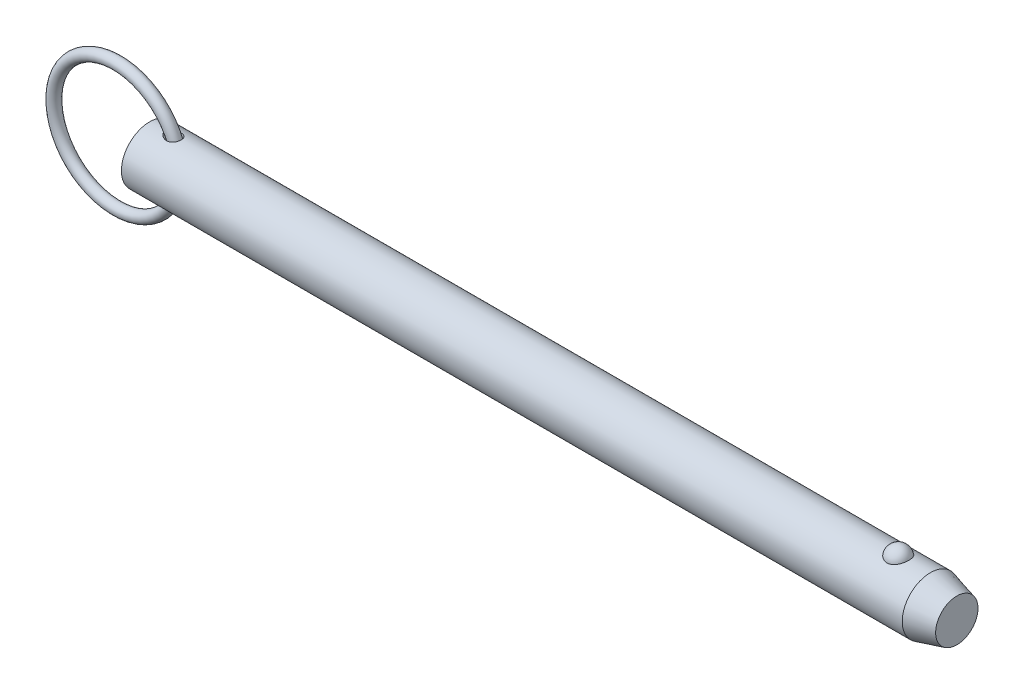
ISO-10303-21;
HEADER;
FILE_DESCRIPTION(('STEP AP214'),'2;1');
FILE_NAME('part.step','',(''),(''),'','','');
FILE_SCHEMA(('AUTOMOTIVE_DESIGN { 1 0 10303 214 1 1 1 1 }'));
ENDSEC;
DATA;
#1=APPLICATION_CONTEXT('core data for automotive mechanical design processes');
#2=APPLICATION_PROTOCOL_DEFINITION('international standard','automotive_design',2000,#1);
#3=PRODUCT_CONTEXT('',#1,'mechanical');
#4=PRODUCT('Part','Part','',(#3));
#5=PRODUCT_RELATED_PRODUCT_CATEGORY('part','',(#4));
#6=PRODUCT_DEFINITION_FORMATION('','',#4);
#7=PRODUCT_DEFINITION_CONTEXT('part definition',#1,'design');
#8=PRODUCT_DEFINITION('design','',#6,#7);
#9=PRODUCT_DEFINITION_SHAPE('','',#8);
#10=(LENGTH_UNIT() NAMED_UNIT(*) SI_UNIT(.MILLI.,.METRE.));
#11=(NAMED_UNIT(*) PLANE_ANGLE_UNIT() SI_UNIT($,.RADIAN.));
#12=(NAMED_UNIT(*) SI_UNIT($,.STERADIAN.) SOLID_ANGLE_UNIT());
#13=UNCERTAINTY_MEASURE_WITH_UNIT(LENGTH_MEASURE(1.E-05),#10,'distance_accuracy_value','');
#14=(GEOMETRIC_REPRESENTATION_CONTEXT(3) GLOBAL_UNCERTAINTY_ASSIGNED_CONTEXT((#13)) GLOBAL_UNIT_ASSIGNED_CONTEXT((#10,
#11,#12)) REPRESENTATION_CONTEXT('',''));
#15=CARTESIAN_POINT('',(0.,0.,0.));
#16=DIRECTION('',(0.,0.,1.));
#17=DIRECTION('',(1.,0.,0.));
#18=AXIS2_PLACEMENT_3D('',#15,#16,#17);
#19=CARTESIAN_POINT('',(-8.23730968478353,0.,0.));
#20=DIRECTION('',(0.,0.,1.));
#21=DIRECTION('',(1.,0.,0.));
#22=AXIS2_PLACEMENT_3D('',#19,#20,#21);
#23=TOROIDAL_SURFACE('',#22,15.875,1.422);
#24=CARTESIAN_POINT('',(9.05969031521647,0.,0.));
#25=VERTEX_POINT('',#24);
#26=VERTEX_LOOP('',#25);
#27=FACE_BOUND('',#26,.T.);
#28=ADVANCED_FACE('P0_F12',(#27),#23,.T.);
#29=CLOSED_SHELL('',(#28));
#30=MANIFOLD_SOLID_BREP('P0_B1',#29);
#31=CARTESIAN_POINT('',(0.,0.,0.));
#32=DIRECTION('',(1.,0.,0.));
#33=DIRECTION('',(0.,0.,-1.));
#34=AXIS2_PLACEMENT_3D('',#31,#32,#33);
#35=CYLINDRICAL_SURFACE('',#34,7.11);
#36=CARTESIAN_POINT('',(3.98467340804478,7.10072679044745,-0.363013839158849));
#37=CARTESIAN_POINT('',(4.00971652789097,7.09600153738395,-0.45539194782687));
#38=CARTESIAN_POINT('',(4.04401947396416,7.08958406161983,-0.545230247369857));
#39=CARTESIAN_POINT('',(4.12810160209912,7.07427055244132,-0.717157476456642));
#40=CARTESIAN_POINT('',(4.17791765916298,7.06536861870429,-0.799227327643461));
#41=CARTESIAN_POINT('',(4.28924471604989,7.04620300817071,-0.953469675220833));
#42=CARTESIAN_POINT('',(4.35063580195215,7.035953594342,-1.02573162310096));
#43=CARTESIAN_POINT('',(4.48282610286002,7.01493313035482,-1.16081412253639));
#44=CARTESIAN_POINT('',(4.55362244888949,7.00416223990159,-1.22363754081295));
#45=CARTESIAN_POINT('',(4.71659336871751,6.98090398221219,-1.35055080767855));
#46=CARTESIAN_POINT('',(4.81029272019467,6.96847103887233,-1.41269256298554));
#47=CARTESIAN_POINT('',(5.0057240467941,6.94515366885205,-1.52319699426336));
#48=CARTESIAN_POINT('',(5.10746392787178,6.93427079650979,-1.57154588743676));
#49=CARTESIAN_POINT('',(5.33503739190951,6.91346066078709,-1.66091325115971));
#50=CARTESIAN_POINT('',(5.46199550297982,6.90402388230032,-1.69921932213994));
#51=CARTESIAN_POINT('',(5.72084799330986,6.89024030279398,-1.75428261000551));
#52=CARTESIAN_POINT('',(5.85274301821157,6.88589416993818,-1.77103699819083));
#53=CARTESIAN_POINT('',(6.11557710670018,6.88337277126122,-1.78081990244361));
#54=CARTESIAN_POINT('',(6.24650031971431,6.88510489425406,-1.77420448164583));
#55=CARTESIAN_POINT('',(6.50446311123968,6.89478744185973,-1.73620392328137));
#56=CARTESIAN_POINT('',(6.6315075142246,6.90272978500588,-1.70485097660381));
#57=CARTESIAN_POINT('',(6.85933269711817,6.92243075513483,-1.62281888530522));
#58=CARTESIAN_POINT('',(6.96133251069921,6.93352131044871,-1.5753580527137));
#59=CARTESIAN_POINT('',(7.15436649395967,6.95824811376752,-1.46226310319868));
#60=CARTESIAN_POINT('',(7.24540699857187,6.97188287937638,-1.3966395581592));
#61=CARTESIAN_POINT('',(7.40446019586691,6.99838217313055,-1.25668991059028));
#62=CARTESIAN_POINT('',(7.473875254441,7.01118308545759,-1.18393777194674));
#63=CARTESIAN_POINT('',(7.59904891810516,7.03582803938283,-1.02736918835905));
#64=CARTESIAN_POINT('',(7.65481029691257,7.04767227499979,-0.943554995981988));
#65=CARTESIAN_POINT('',(7.74982438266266,7.06873077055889,-0.76979592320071));
#66=CARTESIAN_POINT('',(7.7894903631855,7.07800861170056,-0.680084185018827));
#67=CARTESIAN_POINT('',(7.85354088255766,7.09334756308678,-0.495102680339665));
#68=CARTESIAN_POINT('',(7.87792559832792,7.09940871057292,-0.399832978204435));
#69=CARTESIAN_POINT('',(7.9108898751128,7.10766731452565,-0.206294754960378));
#70=CARTESIAN_POINT('',(7.91944662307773,7.10985919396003,-0.108022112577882));
#71=CARTESIAN_POINT('',(7.920501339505,7.11012756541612,0.0886168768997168));
#72=CARTESIAN_POINT('',(7.91299895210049,7.10820396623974,0.186983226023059));
#73=CARTESIAN_POINT('',(7.88205794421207,7.10043733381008,0.381270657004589));
#74=CARTESIAN_POINT('',(7.85857985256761,7.09458459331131,0.477185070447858));
#75=CARTESIAN_POINT('',(7.79617406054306,7.07958431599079,0.663575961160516));
#76=CARTESIAN_POINT('',(7.75724672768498,7.07043685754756,0.754052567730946));
#77=CARTESIAN_POINT('',(7.66496731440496,7.04987259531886,0.926798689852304));
#78=CARTESIAN_POINT('',(7.61164530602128,7.0384605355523,1.00908483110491));
#79=CARTESIAN_POINT('',(7.49191707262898,7.01461776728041,1.16333092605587));
#80=CARTESIAN_POINT('',(7.42551210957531,7.00218715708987,1.235291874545));
#81=CARTESIAN_POINT('',(7.28164031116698,6.97770944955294,1.36680167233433));
#82=CARTESIAN_POINT('',(7.20420170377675,6.96566146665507,1.42638126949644));
#83=CARTESIAN_POINT('',(7.0403906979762,6.94319963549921,1.53199377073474));
#84=CARTESIAN_POINT('',(6.95401827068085,6.93278579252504,1.57802663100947));
#85=CARTESIAN_POINT('',(6.7731858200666,6.91444459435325,1.65656940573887));
#86=CARTESIAN_POINT('',(6.67860569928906,6.90656682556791,1.68881327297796));
#87=CARTESIAN_POINT('',(6.48544119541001,6.89422806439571,1.73849768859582));
#88=CARTESIAN_POINT('',(6.38685561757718,6.88976809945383,1.755933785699));
#89=CARTESIAN_POINT('',(6.18089829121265,6.88429907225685,1.77726234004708));
#90=CARTESIAN_POINT('',(6.07340937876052,6.88356485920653,1.78007646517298));
#91=CARTESIAN_POINT('',(5.85921220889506,6.886086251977,1.77029087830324));
#92=CARTESIAN_POINT('',(5.75250426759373,6.88934339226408,1.75768523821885));
#93=CARTESIAN_POINT('',(5.52848027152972,6.89994454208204,1.71563399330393));
#94=CARTESIAN_POINT('',(5.41155168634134,6.90775772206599,1.68424184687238));
#95=CARTESIAN_POINT('',(5.18376466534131,6.92670168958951,1.60454711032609));
#96=CARTESIAN_POINT('',(5.07291446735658,6.9378368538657,1.5562221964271));
#97=CARTESIAN_POINT('',(4.84835244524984,6.96347168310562,1.43744827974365));
#98=CARTESIAN_POINT('',(4.73562531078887,6.97820486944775,1.36517310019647));
#99=CARTESIAN_POINT('',(4.52504912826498,7.00822340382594,1.20158053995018));
#100=CARTESIAN_POINT('',(4.42717478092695,7.02350775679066,1.11029618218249));
#101=CARTESIAN_POINT('',(4.27935716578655,7.04784659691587,0.940654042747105));
#102=CARTESIAN_POINT('',(4.2239722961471,7.05736064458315,0.867099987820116));
#103=CARTESIAN_POINT('',(4.12558347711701,7.07469854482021,0.711919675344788));
#104=CARTESIAN_POINT('',(4.08256922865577,7.0825238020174,0.630300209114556));
#105=CARTESIAN_POINT('',(4.01142860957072,7.09565978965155,0.459428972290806));
#106=CARTESIAN_POINT('',(3.98346043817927,7.10094374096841,0.370107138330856));
#107=CARTESIAN_POINT('',(3.95517285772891,7.1063173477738,0.233358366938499));
#108=CARTESIAN_POINT('',(3.94802115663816,7.1076831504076,0.187321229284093));
#109=CARTESIAN_POINT('',(3.93842121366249,7.10951900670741,0.0947476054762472));
#110=CARTESIAN_POINT('',(3.93597129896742,7.10998937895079,0.0482113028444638));
#111=CARTESIAN_POINT('',(3.93584361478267,7.11001358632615,-0.0598597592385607));
#112=CARTESIAN_POINT('',(3.9399538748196,7.10922402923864,-0.121405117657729));
#113=CARTESIAN_POINT('',(3.95632793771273,7.10609781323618,-0.243320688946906));
#114=CARTESIAN_POINT('',(3.96859135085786,7.10376122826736,-0.303690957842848));
#115=CARTESIAN_POINT('',(3.98467340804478,7.10072679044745,-0.363013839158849));
#116=B_SPLINE_CURVE_WITH_KNOTS('',3,(#36,#37,#38,#39,#40,#41,#42,#43,#44,#45,#46,#47,#48,#49,
#50,#51,#52,#53,#54,#55,#56,#57,#58,#59,#60,#61,#62,#63,#64,#65,#66,#67,#68,#69,#70,#71,#72,#73,
#74,#75,#76,#77,#78,#79,#80,#81,#82,#83,#84,#85,#86,#87,#88,#89,#90,#91,#92,#93,#94,#95,#96,#97,
#98,#99,#100,#101,#102,#103,#104,#105,#106,#107,#108,#109,#110,#111,#112,#113,#114,#115),
.UNSPECIFIED.,.T.,.F.,(4,2,2,2,2,2,2,2,2,2,2,2,2,2,2,2,2,2,2,2,2,2,2,2,2,2,2,2,2,2,2,2,2,2,2,2,
2,2,2,4),(0.,0.287206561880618,0.575101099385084,0.860162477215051,1.14513709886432,
1.48324846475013,1.82169652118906,2.21865672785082,2.6156690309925,3.00665870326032,
3.39714041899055,3.73437585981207,4.07141541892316,4.37402271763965,4.67656849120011,
4.97076150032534,5.26495110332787,5.55956439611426,5.85418421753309,6.14953461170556,
6.44487798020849,6.73960905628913,7.03431171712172,7.32827352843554,7.6222362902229,
7.9216396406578,8.22113296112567,8.54242840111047,8.86384740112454,9.22635035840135,
9.58933304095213,9.99153142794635,10.3930368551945,10.6697219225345,10.9461759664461,
11.2254825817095,11.3650959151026,11.5046595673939,11.6891051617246,11.8735419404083),.UNSPECIFIED.);
#117=CARTESIAN_POINT('',(3.98467340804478,7.10072679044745,-0.363013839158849));
#118=VERTEX_POINT('',#117);
#119=EDGE_CURVE('P1_E40',#118,#118,#116,.T.);
#120=ORIENTED_EDGE('',*,*,#119,.T.);
#121=EDGE_LOOP('',(#120));
#122=FACE_BOUND('',#121,.T.);
#123=CARTESIAN_POINT('',(196.536279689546,0.,0.));
#124=DIRECTION('',(1.,0.,0.));
#125=DIRECTION('',(0.,0.,-1.));
#126=AXIS2_PLACEMENT_3D('',#123,#124,#125);
#127=CIRCLE('',#126,7.11);
#128=CARTESIAN_POINT('',(196.536279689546,0.,-7.11));
#129=VERTEX_POINT('',#128);
#130=EDGE_CURVE('P1_E25',#129,#129,#127,.T.);
#131=ORIENTED_EDGE('',*,*,#130,.F.);
#132=EDGE_LOOP('',(#131));
#133=FACE_BOUND('',#132,.T.);
#134=CARTESIAN_POINT('',(0.,0.,0.));
#135=DIRECTION('',(1.,0.,0.));
#136=DIRECTION('',(0.,0.,-1.));
#137=AXIS2_PLACEMENT_3D('',#134,#135,#136);
#138=CIRCLE('',#137,7.11);
#139=CARTESIAN_POINT('',(0.,0.,-7.11));
#140=VERTEX_POINT('',#139);
#141=EDGE_CURVE('P1_E9',#140,#140,#138,.T.);
#142=ORIENTED_EDGE('',*,*,#141,.T.);
#143=EDGE_LOOP('',(#142));
#144=FACE_BOUND('',#143,.T.);
#145=CARTESIAN_POINT('',(188.429258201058,6.53646663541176,2.79762469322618));
#146=CARTESIAN_POINT('',(188.284429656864,6.53647876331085,2.79761243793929));
#147=CARTESIAN_POINT('',(188.139368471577,6.54144531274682,2.78608115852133));
#148=CARTESIAN_POINT('',(187.853292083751,6.56077791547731,2.74023282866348));
#149=CARTESIAN_POINT('',(187.71228845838,6.57516852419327,2.70585624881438));
#150=CARTESIAN_POINT('',(187.43888335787,6.61165072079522,2.61544042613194));
#151=CARTESIAN_POINT('',(187.306460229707,6.63372195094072,2.55945840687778));
#152=CARTESIAN_POINT('',(187.053233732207,6.68316012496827,2.42742958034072));
#153=CARTESIAN_POINT('',(186.932425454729,6.71052481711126,2.35139129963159));
#154=CARTESIAN_POINT('',(186.701637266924,6.76860821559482,2.17866150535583));
#155=CARTESIAN_POINT('',(186.592085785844,6.79940242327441,2.08142342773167));
#156=CARTESIAN_POINT('',(186.39033404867,6.86050242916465,1.8702090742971));
#157=CARTESIAN_POINT('',(186.298139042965,6.89080807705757,1.7562277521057));
#158=CARTESIAN_POINT('',(186.12925478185,6.94923069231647,1.509006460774));
#159=CARTESIAN_POINT('',(186.053428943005,6.97719213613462,1.37513873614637));
#160=CARTESIAN_POINT('',(185.924206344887,7.02647251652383,1.0958481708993));
#161=CARTESIAN_POINT('',(185.870810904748,7.04779106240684,0.950424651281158));
#162=CARTESIAN_POINT('',(185.787101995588,7.08180248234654,0.650508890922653));
#163=CARTESIAN_POINT('',(185.757025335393,7.09440672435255,0.49594033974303));
#164=CARTESIAN_POINT('',(185.721473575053,7.10935121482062,0.183515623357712));
#165=CARTESIAN_POINT('',(185.715997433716,7.11169189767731,0.0256595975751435));
#166=CARTESIAN_POINT('',(185.729700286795,7.10589702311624,-0.287512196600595));
#167=CARTESIAN_POINT('',(185.74868231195,7.0978451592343,-0.442838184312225));
#168=CARTESIAN_POINT('',(185.81057450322,7.07221860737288,-0.747830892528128));
#169=CARTESIAN_POINT('',(185.853485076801,7.05464375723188,-0.897497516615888));
#170=CARTESIAN_POINT('',(185.962452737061,7.01171031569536,-1.18722864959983));
#171=CARTESIAN_POINT('',(186.028545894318,6.98633960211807,-1.32727778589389));
#172=CARTESIAN_POINT('',(186.182536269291,6.93042258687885,-1.59370324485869));
#173=CARTESIAN_POINT('',(186.270435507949,6.89987580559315,-1.72007829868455));
#174=CARTESIAN_POINT('',(186.466926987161,6.8365951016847,-1.9565734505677));
#175=CARTESIAN_POINT('',(186.575664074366,6.80384697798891,-2.06656957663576));
#176=CARTESIAN_POINT('',(186.810968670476,6.74001831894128,-2.26611005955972));
#177=CARTESIAN_POINT('',(186.937535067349,6.70893767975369,-2.35565569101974));
#178=CARTESIAN_POINT('',(187.202845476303,6.65264442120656,-2.51019726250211));
#179=CARTESIAN_POINT('',(187.341323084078,6.62733449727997,-2.57561395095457));
#180=CARTESIAN_POINT('',(187.628519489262,6.58495995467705,-2.68211134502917));
#181=CARTESIAN_POINT('',(187.777234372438,6.56789220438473,-2.72320129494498));
#182=CARTESIAN_POINT('',(188.072626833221,6.54478663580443,-2.77825810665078));
#183=CARTESIAN_POINT('',(188.219029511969,6.53823639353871,-2.79348727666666));
#184=CARTESIAN_POINT('',(188.512470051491,6.53532718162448,-2.8002892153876));
#185=CARTESIAN_POINT('',(188.659507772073,6.53896606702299,-2.79186696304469));
#186=CARTESIAN_POINT('',(188.944921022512,6.55570357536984,-2.75232178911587));
#187=CARTESIAN_POINT('',(189.083422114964,6.56848455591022,-2.72196077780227));
#188=CARTESIAN_POINT('',(189.353114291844,6.60173528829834,-2.64028774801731));
#189=CARTESIAN_POINT('',(189.484304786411,6.62220565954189,-2.58897404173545));
#190=CARTESIAN_POINT('',(189.738846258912,6.66917927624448,-2.46547820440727));
#191=CARTESIAN_POINT('',(189.861969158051,6.69580233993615,-2.39287266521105));
#192=CARTESIAN_POINT('',(190.094441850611,6.75207041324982,-2.22915269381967));
#193=CARTESIAN_POINT('',(190.203788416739,6.78171612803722,-2.13803393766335));
#194=CARTESIAN_POINT('',(190.411642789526,6.84264629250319,-1.93445592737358));
#195=CARTESIAN_POINT('',(190.509317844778,6.8739374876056,-1.82114774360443));
#196=CARTESIAN_POINT('',(190.685011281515,6.93345710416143,-1.57947787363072));
#197=CARTESIAN_POINT('',(190.763026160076,6.96168497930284,-1.45111351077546));
#198=CARTESIAN_POINT('',(190.899985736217,7.0130755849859,-1.17842708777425));
#199=CARTESIAN_POINT('',(190.958258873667,7.03605262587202,-1.03373189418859));
#200=CARTESIAN_POINT('',(191.051081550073,7.07340932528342,-0.735867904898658));
#201=CARTESIAN_POINT('',(191.085631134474,7.08778900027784,-0.58269912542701));
#202=CARTESIAN_POINT('',(191.130274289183,7.10647639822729,-0.272420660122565));
#203=CARTESIAN_POINT('',(191.14039710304,7.11079616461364,-0.115315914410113));
#204=CARTESIAN_POINT('',(191.136061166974,7.10896059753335,0.198488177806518));
#205=CARTESIAN_POINT('',(191.121603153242,7.10280557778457,0.355187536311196));
#206=CARTESIAN_POINT('',(191.068572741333,7.08071500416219,0.66272439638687));
#207=CARTESIAN_POINT('',(191.03015058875,7.06484039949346,0.813592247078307));
#208=CARTESIAN_POINT('',(190.930101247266,7.0249589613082,1.10629159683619));
#209=CARTESIAN_POINT('',(190.868472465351,7.00095156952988,1.24812247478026));
#210=CARTESIAN_POINT('',(190.722766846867,6.94706632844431,1.5197643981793));
#211=CARTESIAN_POINT('',(190.638544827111,6.91715085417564,1.64949012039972));
#212=CARTESIAN_POINT('',(190.449586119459,6.85470565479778,1.89231285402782));
#213=CARTESIAN_POINT('',(190.344850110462,6.82217601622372,2.00541041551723));
#214=CARTESIAN_POINT('',(190.117103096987,6.75805358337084,2.2119067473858));
#215=CARTESIAN_POINT('',(189.994082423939,6.7264612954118,2.30529503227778));
#216=CARTESIAN_POINT('',(189.73273470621,6.66789520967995,2.46959908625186));
#217=CARTESIAN_POINT('',(189.594401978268,6.64092313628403,2.54050647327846));
#218=CARTESIAN_POINT('',(189.311182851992,6.59572583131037,2.65560045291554));
#219=CARTESIAN_POINT('',(189.166666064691,6.57724013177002,2.70059539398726));
#220=CARTESIAN_POINT('',(188.871546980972,6.55006426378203,2.7658732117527));
#221=CARTESIAN_POINT('',(188.720964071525,6.54134511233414,2.78622922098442));
#222=CARTESIAN_POINT('',(188.523046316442,6.53697847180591,2.79642434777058));
#223=CARTESIAN_POINT('',(188.476164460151,6.53646270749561,2.79762866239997));
#224=CARTESIAN_POINT('',(188.429258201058,6.53646663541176,2.79762469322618));
#225=B_SPLINE_CURVE_WITH_KNOTS('',3,(#145,#146,#147,#148,#149,#150,#151,#152,#153,#154,#155,
#156,#157,#158,#159,#160,#161,#162,#163,#164,#165,#166,#167,#168,#169,#170,#171,#172,#173,#174,
#175,#176,#177,#178,#179,#180,#181,#182,#183,#184,#185,#186,#187,#188,#189,#190,#191,#192,#193,
#194,#195,#196,#197,#198,#199,#200,#201,#202,#203,#204,#205,#206,#207,#208,#209,#210,#211,#212,
#213,#214,#215,#216,#217,#218,#219,#220,#221,#222,#223,#224),.UNSPECIFIED.,.T.,.F.,(4,2,2,2,2,2,
2,2,2,2,2,2,2,2,2,2,2,2,2,2,2,2,2,2,2,2,2,2,2,2,2,2,2,2,2,2,2,2,2,4),(0.,0.434355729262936,
0.869847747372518,1.30419416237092,1.73835621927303,2.18541922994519,2.63261726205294,
3.09954261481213,3.56649542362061,4.03813031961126,4.50974525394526,4.97758575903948,
5.44543423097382,5.91401389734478,6.38263700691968,6.85464418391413,7.32662193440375,
7.78992971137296,8.25306131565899,8.69285754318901,9.13256119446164,9.55768625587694,
9.98284556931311,10.4171106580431,10.8514772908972,11.3079089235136,11.7644218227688,
12.2351898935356,12.7059570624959,13.1761603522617,13.6463495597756,14.1136200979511,
14.5809227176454,15.051303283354,15.5216682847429,15.9922828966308,16.463072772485,
16.9182457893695,17.3720644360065,17.512741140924),.UNSPECIFIED.);
#226=CARTESIAN_POINT('',(188.429258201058,6.53646663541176,2.79762469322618));
#227=VERTEX_POINT('',#226);
#228=EDGE_CURVE('P1_E34',#227,#227,#225,.T.);
#229=ORIENTED_EDGE('',*,*,#228,.T.);
#230=EDGE_LOOP('',(#229));
#231=FACE_BOUND('',#230,.T.);
#232=CARTESIAN_POINT('',(3.98467340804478,-7.10072679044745,-0.363013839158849));
#233=CARTESIAN_POINT('',(3.96426456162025,-7.10457733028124,-0.287714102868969));
#234=CARTESIAN_POINT('',(3.95000501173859,-7.10730349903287,-0.210695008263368));
#235=CARTESIAN_POINT('',(3.93481801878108,-7.11020840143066,-0.0553038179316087));
#236=CARTESIAN_POINT('',(3.93388435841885,-7.11038832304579,0.0230676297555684));
#237=CARTESIAN_POINT('',(3.94541910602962,-7.10817995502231,0.178714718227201));
#238=CARTESIAN_POINT('',(3.95787987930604,-7.10579312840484,0.25599095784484));
#239=CARTESIAN_POINT('',(3.99523775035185,-7.09872642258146,0.407352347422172));
#240=CARTESIAN_POINT('',(4.02014065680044,-7.09404547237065,0.481435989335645));
#241=CARTESIAN_POINT('',(4.08119600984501,-7.08278363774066,0.625775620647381));
#242=CARTESIAN_POINT('',(4.11749458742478,-7.07617815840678,0.695967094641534));
#243=CARTESIAN_POINT('',(4.19940836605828,-7.06165305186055,0.830508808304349));
#244=CARTESIAN_POINT('',(4.24502952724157,-7.0537325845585,0.894855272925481));
#245=CARTESIAN_POINT('',(4.36790232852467,-7.03310314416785,1.04688574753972));
#246=CARTESIAN_POINT('',(4.44977459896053,-7.01993229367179,1.13078695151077));
#247=CARTESIAN_POINT('',(4.62610796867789,-6.99351259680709,1.28411726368));
#248=CARTESIAN_POINT('',(4.7205898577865,-6.98026365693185,1.35352197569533));
#249=CARTESIAN_POINT('',(4.92036507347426,-6.9549104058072,1.47831921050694));
#250=CARTESIAN_POINT('',(5.02579054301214,-6.94282458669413,1.53350332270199));
#251=CARTESIAN_POINT('',(5.24378330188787,-6.92129098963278,1.62793610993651));
#252=CARTESIAN_POINT('',(5.35635066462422,-6.91184323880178,1.66718462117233));
#253=CARTESIAN_POINT('',(5.60134354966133,-6.89573491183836,1.73269893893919));
#254=CARTESIAN_POINT('',(5.73444697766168,-6.8895970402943,1.75661057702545));
#255=CARTESIAN_POINT('',(6.00300738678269,-6.88344616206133,1.78057487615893));
#256=CARTESIAN_POINT('',(6.13846360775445,-6.88343121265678,1.78063510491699));
#257=CARTESIAN_POINT('',(6.39660470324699,-6.88981379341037,1.75576480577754));
#258=CARTESIAN_POINT('',(6.51947843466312,-6.89572457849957,1.73273121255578));
#259=CARTESIAN_POINT('',(6.75813770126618,-6.91274434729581,1.66352936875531));
#260=CARTESIAN_POINT('',(6.87393155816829,-6.92384709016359,1.61738888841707));
#261=CARTESIAN_POINT('',(7.07801861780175,-6.94787316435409,1.51052664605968));
#262=CARTESIAN_POINT('',(7.16789841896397,-6.96033024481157,1.45271574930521));
#263=CARTESIAN_POINT('',(7.33546773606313,-6.98638661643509,1.32171912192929));
#264=CARTESIAN_POINT('',(7.41316182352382,-6.99998547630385,1.24853918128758));
#265=CARTESIAN_POINT('',(7.54861420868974,-7.02559503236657,1.09486170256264));
#266=CARTESIAN_POINT('',(7.60741145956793,-7.03764930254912,1.01528346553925));
#267=CARTESIAN_POINT('',(7.71070740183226,-7.0598657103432,0.847099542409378));
#268=CARTESIAN_POINT('',(7.75520788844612,-7.0700280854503,0.758494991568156));
#269=CARTESIAN_POINT('',(7.82836147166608,-7.08722075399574,0.575936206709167));
#270=CARTESIAN_POINT('',(7.85719783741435,-7.09428707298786,0.482058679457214));
#271=CARTESIAN_POINT('',(7.89918378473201,-7.10470260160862,0.29065874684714));
#272=CARTESIAN_POINT('',(7.91233308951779,-7.10805174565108,0.193136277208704));
#273=CARTESIAN_POINT('',(7.92267451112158,-7.11067890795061,-0.00313968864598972));
#274=CARTESIAN_POINT('',(7.91981203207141,-7.10994299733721,-0.10189624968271));
#275=CARTESIAN_POINT('',(7.89806489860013,-7.10444651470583,-0.297516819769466));
#276=CARTESIAN_POINT('',(7.87918005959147,-7.09968589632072,-0.394380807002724));
#277=CARTESIAN_POINT('',(7.82577988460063,-7.0866471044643,-0.58355375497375));
#278=CARTESIAN_POINT('',(7.79124976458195,-7.07836560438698,-0.675858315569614));
#279=CARTESIAN_POINT('',(7.70736343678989,-7.05919003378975,-0.853167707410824));
#280=CARTESIAN_POINT('',(7.65800801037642,-7.04829610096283,-0.938172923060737));
#281=CARTESIAN_POINT('',(7.54590141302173,-7.02513961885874,-1.09819812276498));
#282=CARTESIAN_POINT('',(7.48319521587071,-7.01288172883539,-1.17325029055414));
#283=CARTESIAN_POINT('',(7.34599775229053,-6.98832192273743,-1.31164333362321));
#284=CARTESIAN_POINT('',(7.27150757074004,-6.97602001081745,-1.37498528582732));
#285=CARTESIAN_POINT('',(7.11277776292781,-6.95268608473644,-1.48849974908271));
#286=CARTESIAN_POINT('',(7.02852525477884,-6.94165578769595,-1.53865456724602));
#287=CARTESIAN_POINT('',(6.85282430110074,-6.92200320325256,-1.62478650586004));
#288=CARTESIAN_POINT('',(6.76137511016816,-6.91338116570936,-1.66076215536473));
#289=CARTESIAN_POINT('',(6.57061179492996,-6.89906044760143,-1.71930563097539));
#290=CARTESIAN_POINT('',(6.47113516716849,-6.89347290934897,-1.74136795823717));
#291=CARTESIAN_POINT('',(6.26989833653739,-6.88605020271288,-1.7704895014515));
#292=CARTESIAN_POINT('',(6.16813737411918,-6.88421630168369,-1.77754365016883));
#293=CARTESIAN_POINT('',(5.95492537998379,-6.88424071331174,-1.77745174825));
#294=CARTESIAN_POINT('',(5.8434768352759,-6.88646827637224,-1.76888555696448));
#295=CARTESIAN_POINT('',(5.62307560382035,-6.89483827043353,-1.73596677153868));
#296=CARTESIAN_POINT('',(5.51412477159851,-6.90098351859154,-1.71160281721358));
#297=CARTESIAN_POINT('',(5.28644478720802,-6.91743803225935,-1.64393691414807));
#298=CARTESIAN_POINT('',(5.16837217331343,-6.92819628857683,-1.59852806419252));
#299=CARTESIAN_POINT('',(4.94091825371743,-6.95234836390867,-1.4899796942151));
#300=CARTESIAN_POINT('',(4.83153887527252,-6.96574276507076,-1.42683625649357));
#301=CARTESIAN_POINT('',(4.63576710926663,-6.99209234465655,-1.29112257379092));
#302=CARTESIAN_POINT('',(4.54816728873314,-7.00494184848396,-1.22027748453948));
#303=CARTESIAN_POINT('',(4.38554897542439,-7.03019055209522,-1.0652111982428));
#304=CARTESIAN_POINT('',(4.31052141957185,-7.04259007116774,-0.980999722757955));
#305=CARTESIAN_POINT('',(4.18551811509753,-7.0640229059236,-0.811206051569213));
#306=CARTESIAN_POINT('',(4.13358417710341,-7.07328321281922,-0.727107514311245));
#307=CARTESIAN_POINT('',(4.04607461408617,-7.0891994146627,-0.550580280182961));
#308=CARTESIAN_POINT('',(4.01046401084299,-7.09586087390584,-0.458169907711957));
#309=CARTESIAN_POINT('',(3.98467340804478,-7.10072679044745,-0.363013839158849));
#310=B_SPLINE_CURVE_WITH_KNOTS('',3,(#232,#233,#234,#235,#236,#237,#238,#239,#240,#241,#242,
#243,#244,#245,#246,#247,#248,#249,#250,#251,#252,#253,#254,#255,#256,#257,#258,#259,#260,#261,
#262,#263,#264,#265,#266,#267,#268,#269,#270,#271,#272,#273,#274,#275,#276,#277,#278,#279,#280,
#281,#282,#283,#284,#285,#286,#287,#288,#289,#290,#291,#292,#293,#294,#295,#296,#297,#298,#299,
#300,#301,#302,#303,#304,#305,#306,#307,#308,#309),.UNSPECIFIED.,.T.,.F.,(4,2,2,2,2,2,2,2,2,2,2,
2,2,2,2,2,2,2,2,2,2,2,2,2,2,2,2,2,2,2,2,2,2,2,2,2,2,2,4),(0.,0.23402065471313,0.467932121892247,
0.701710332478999,0.935597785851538,1.17261620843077,1.40978663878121,1.76177576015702,
2.11435255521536,2.47183528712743,2.8293216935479,3.23332937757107,3.63720887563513,
4.01042610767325,4.38319587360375,4.70425151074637,5.02518641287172,5.32277979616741,
5.62033579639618,5.91433101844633,6.2083314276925,6.50333490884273,6.79834178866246,
7.09362801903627,7.38889868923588,7.6831900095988,7.9774542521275,8.27211131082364,
8.56679892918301,8.8716552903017,9.17661456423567,9.51069129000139,9.84500851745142,
10.2243046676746,10.6036846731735,10.9425776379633,11.2812252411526,11.5775945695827,
11.8733258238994),.UNSPECIFIED.);
#311=CARTESIAN_POINT('',(3.98467340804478,-7.10072679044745,-0.363013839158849));
#312=VERTEX_POINT('',#311);
#313=EDGE_CURVE('P1_E17',#312,#312,#310,.T.);
#314=ORIENTED_EDGE('',*,*,#313,.T.);
#315=EDGE_LOOP('',(#314));
#316=FACE_BOUND('',#315,.T.);
#317=ADVANCED_FACE('P1_F13',(#122,#133,#144,#231,#316),#35,.T.);
#318=CARTESIAN_POINT('',(0.,0.,0.));
#319=DIRECTION('',(-1.,0.,0.));
#320=DIRECTION('',(0.,0.,1.));
#321=AXIS2_PLACEMENT_3D('',#318,#319,#320);
#322=PLANE('',#321);
#323=ORIENTED_EDGE('',*,*,#141,.F.);
#324=EDGE_LOOP('',(#323));
#325=FACE_BOUND('',#324,.T.);
#326=ADVANCED_FACE('P1_F15',(#325),#322,.T.);
#327=CARTESIAN_POINT('',(203.17,0.,0.));
#328=DIRECTION('',(-1.,0.,0.));
#329=DIRECTION('',(0.,0.,1.));
#330=AXIS2_PLACEMENT_3D('',#327,#328,#329);
#331=CONICAL_SURFACE('',#330,5.33250000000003,0.26179938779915);
#332=ORIENTED_EDGE('',*,*,#130,.T.);
#333=EDGE_LOOP('',(#332));
#334=FACE_BOUND('',#333,.T.);
#335=CARTESIAN_POINT('',(203.17,0.,0.));
#336=DIRECTION('',(1.,0.,0.));
#337=DIRECTION('',(0.,0.,-1.));
#338=AXIS2_PLACEMENT_3D('',#335,#336,#337);
#339=CIRCLE('',#338,5.33250000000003);
#340=CARTESIAN_POINT('',(203.17,0.,-5.33250000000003));
#341=VERTEX_POINT('',#340);
#342=EDGE_CURVE('P1_E30',#341,#341,#339,.T.);
#343=ORIENTED_EDGE('',*,*,#342,.F.);
#344=EDGE_LOOP('',(#343));
#345=FACE_BOUND('',#344,.T.);
#346=ADVANCED_FACE('P1_F55',(#334,#345),#331,.T.);
#347=CARTESIAN_POINT('',(203.17,5.33250000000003,0.));
#348=DIRECTION('',(1.,0.,0.));
#349=DIRECTION('',(0.,0.,-1.));
#350=AXIS2_PLACEMENT_3D('',#347,#348,#349);
#351=PLANE('',#350);
#352=ORIENTED_EDGE('',*,*,#342,.T.);
#353=EDGE_LOOP('',(#352));
#354=FACE_BOUND('',#353,.T.);
#355=ADVANCED_FACE('P1_F51',(#354),#351,.T.);
#356=CARTESIAN_POINT('',(188.429258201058,6.399,0.));
#357=DIRECTION('',(-1.,0.,0.));
#358=DIRECTION('',(0.,-1.,0.));
#359=AXIS2_PLACEMENT_3D('',#356,#357,#358);
#360=SPHERICAL_SURFACE('',#359,2.80100000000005);
#361=ORIENTED_EDGE('',*,*,#228,.F.);
#362=EDGE_LOOP('',(#361));
#363=FACE_BOUND('',#362,.T.);
#364=ADVANCED_FACE('P1_F46',(#363),#360,.T.);
#365=CARTESIAN_POINT('',(-8.23730968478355,0.,0.));
#366=DIRECTION('',(0.,0.,1.));
#367=DIRECTION('',(1.,0.,0.));
#368=AXIS2_PLACEMENT_3D('',#365,#366,#367);
#369=TOROIDAL_SURFACE('',#368,15.875,1.7775);
#370=ORIENTED_EDGE('',*,*,#313,.F.);
#371=EDGE_LOOP('',(#370));
#372=FACE_BOUND('',#371,.T.);
#373=ORIENTED_EDGE('',*,*,#119,.F.);
#374=EDGE_LOOP('',(#373));
#375=FACE_BOUND('',#374,.T.);
#376=ADVANCED_FACE('P1_F50',(#372,#375),#369,.F.);
#377=CLOSED_SHELL('',(#317,#326,#346,#355,#364,#376));
#378=MANIFOLD_SOLID_BREP('P1_B1',#377);
#379=ADVANCED_BREP_SHAPE_REPRESENTATION('',(#18,#30,#378),#14);
#380=SHAPE_DEFINITION_REPRESENTATION(#9,#379);
ENDSEC;
END-ISO-10303-21;
